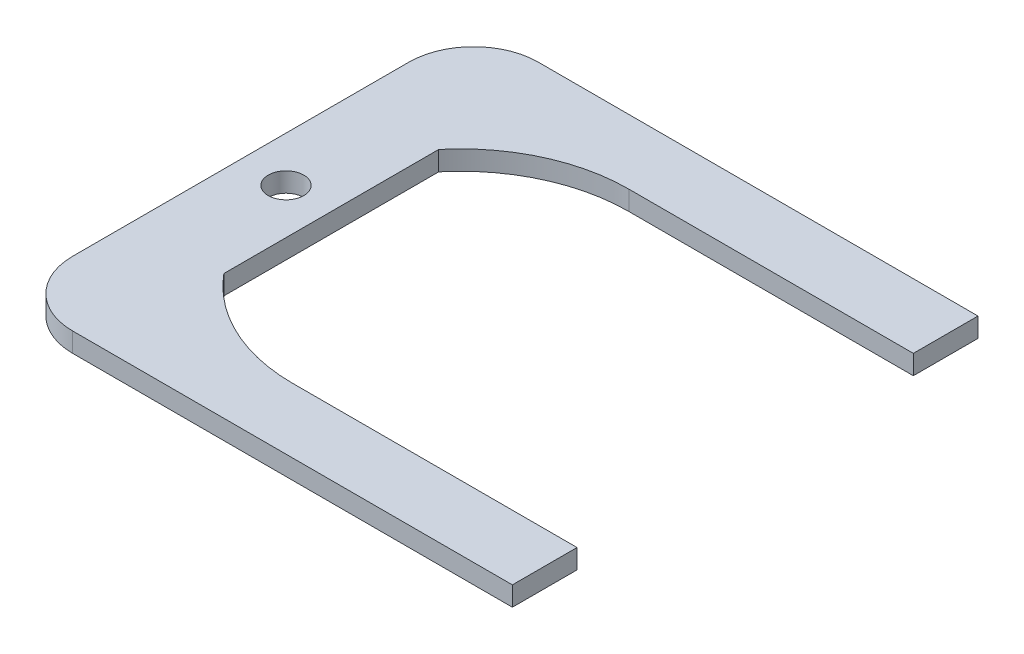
ISO-10303-21;
HEADER;
FILE_DESCRIPTION(('STEP AP214'),'2;1');
FILE_NAME('part.step','',(''),(''),'','','');
FILE_SCHEMA(('AUTOMOTIVE_DESIGN { 1 0 10303 214 1 1 1 1 }'));
ENDSEC;
DATA;
#1=APPLICATION_CONTEXT('core data for automotive mechanical design processes');
#2=APPLICATION_PROTOCOL_DEFINITION('international standard','automotive_design',2000,#1);
#3=PRODUCT_CONTEXT('',#1,'mechanical');
#4=PRODUCT('Part','Part','',(#3));
#5=PRODUCT_RELATED_PRODUCT_CATEGORY('part','',(#4));
#6=PRODUCT_DEFINITION_FORMATION('','',#4);
#7=PRODUCT_DEFINITION_CONTEXT('part definition',#1,'design');
#8=PRODUCT_DEFINITION('design','',#6,#7);
#9=PRODUCT_DEFINITION_SHAPE('','',#8);
#10=(LENGTH_UNIT() NAMED_UNIT(*) SI_UNIT(.MILLI.,.METRE.));
#11=(NAMED_UNIT(*) PLANE_ANGLE_UNIT() SI_UNIT($,.RADIAN.));
#12=(NAMED_UNIT(*) SI_UNIT($,.STERADIAN.) SOLID_ANGLE_UNIT());
#13=UNCERTAINTY_MEASURE_WITH_UNIT(LENGTH_MEASURE(1.E-05),#10,'distance_accuracy_value','');
#14=(GEOMETRIC_REPRESENTATION_CONTEXT(3) GLOBAL_UNCERTAINTY_ASSIGNED_CONTEXT((#13)) GLOBAL_UNIT_ASSIGNED_CONTEXT((#10,
#11,#12)) REPRESENTATION_CONTEXT('',''));
#15=CARTESIAN_POINT('',(0.,0.,0.));
#16=DIRECTION('',(0.,0.,1.));
#17=DIRECTION('',(1.,0.,0.));
#18=AXIS2_PLACEMENT_3D('',#15,#16,#17);
#19=CARTESIAN_POINT('',(3.,3.,-26.));
#20=DIRECTION('',(0.,-1.,0.));
#21=DIRECTION('',(0.,0.,-1.));
#22=AXIS2_PLACEMENT_3D('',#19,#20,#21);
#23=PLANE('',#22);
#24=CARTESIAN_POINT('',(3.,3.,-26.));
#25=DIRECTION('',(0.,1.,0.));
#26=DIRECTION('',(0.,0.,-1.));
#27=AXIS2_PLACEMENT_3D('',#24,#25,#26);
#28=CIRCLE('',#27,10.);
#29=CARTESIAN_POINT('',(3.00000000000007,3.,-36.));
#30=VERTEX_POINT('',#29);
#31=CARTESIAN_POINT('',(-7.,3.,-25.9999999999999));
#32=VERTEX_POINT('',#31);
#33=EDGE_CURVE('E184',#30,#32,#28,.T.);
#34=ORIENTED_EDGE('',*,*,#33,.T.);
#35=DIRECTION('',(0.,0.,1.));
#36=VECTOR('',#35,1.);
#37=CARTESIAN_POINT('',(-7.,3.,25.9999999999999));
#38=LINE('',#37,#36);
#39=CARTESIAN_POINT('',(-7.,3.,25.9999999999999));
#40=VERTEX_POINT('',#39);
#41=EDGE_CURVE('E112',#32,#40,#38,.T.);
#42=ORIENTED_EDGE('',*,*,#41,.T.);
#43=CARTESIAN_POINT('',(3.,3.,26.));
#44=DIRECTION('',(0.,1.,0.));
#45=DIRECTION('',(0.,0.,1.));
#46=AXIS2_PLACEMENT_3D('',#43,#44,#45);
#47=CIRCLE('',#46,10.);
#48=CARTESIAN_POINT('',(3.00000000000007,3.,36.));
#49=VERTEX_POINT('',#48);
#50=EDGE_CURVE('E211',#40,#49,#47,.T.);
#51=ORIENTED_EDGE('',*,*,#50,.T.);
#52=DIRECTION('',(1.,0.,0.));
#53=VECTOR('',#52,1.);
#54=CARTESIAN_POINT('',(3.00000000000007,3.,36.));
#55=LINE('',#54,#53);
#56=CARTESIAN_POINT('',(71.,3.,36.));
#57=VERTEX_POINT('',#56);
#58=EDGE_CURVE('E230',#49,#57,#55,.T.);
#59=ORIENTED_EDGE('',*,*,#58,.T.);
#60=DIRECTION('',(0.,0.,-1.));
#61=VECTOR('',#60,1.);
#62=CARTESIAN_POINT('',(71.,3.,36.));
#63=LINE('',#62,#61);
#64=CARTESIAN_POINT('',(71.,3.,26.));
#65=VERTEX_POINT('',#64);
#66=EDGE_CURVE('E227',#57,#65,#63,.T.);
#67=ORIENTED_EDGE('',*,*,#66,.T.);
#68=DIRECTION('',(-1.,0.,0.));
#69=VECTOR('',#68,1.);
#70=CARTESIAN_POINT('',(71.,3.,26.));
#71=LINE('',#70,#69);
#72=CARTESIAN_POINT('',(27.,3.,26.));
#73=VERTEX_POINT('',#72);
#74=EDGE_CURVE('E229',#65,#73,#71,.T.);
#75=ORIENTED_EDGE('',*,*,#74,.T.);
#76=CARTESIAN_POINT('',(27.,3.,0.));
#77=DIRECTION('',(0.,-1.,0.));
#78=DIRECTION('',(0.,0.,-1.));
#79=AXIS2_PLACEMENT_3D('',#76,#77,#78);
#80=CIRCLE('',#79,26.);
#81=CARTESIAN_POINT('',(7.00000000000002,3.,16.6132477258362));
#82=VERTEX_POINT('',#81);
#83=EDGE_CURVE('E232',#73,#82,#80,.T.);
#84=ORIENTED_EDGE('',*,*,#83,.T.);
#85=DIRECTION('',(0.,0.,-1.));
#86=VECTOR('',#85,1.);
#87=CARTESIAN_POINT('',(7.00000000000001,3.,-16.6132477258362));
#88=LINE('',#87,#86);
#89=CARTESIAN_POINT('',(7.00000000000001,3.,-16.6132477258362));
#90=VERTEX_POINT('',#89);
#91=EDGE_CURVE('E238',#82,#90,#88,.T.);
#92=ORIENTED_EDGE('',*,*,#91,.T.);
#93=CARTESIAN_POINT('',(27.,3.,0.));
#94=DIRECTION('',(0.,-1.,0.));
#95=DIRECTION('',(0.,0.,1.));
#96=AXIS2_PLACEMENT_3D('',#93,#94,#95);
#97=CIRCLE('',#96,26.);
#98=CARTESIAN_POINT('',(27.,3.,-26.));
#99=VERTEX_POINT('',#98);
#100=EDGE_CURVE('E143',#90,#99,#97,.T.);
#101=ORIENTED_EDGE('',*,*,#100,.T.);
#102=DIRECTION('',(1.,0.,0.));
#103=VECTOR('',#102,1.);
#104=CARTESIAN_POINT('',(71.,3.,-26.));
#105=LINE('',#104,#103);
#106=CARTESIAN_POINT('',(71.,3.,-26.));
#107=VERTEX_POINT('',#106);
#108=EDGE_CURVE('E137',#99,#107,#105,.T.);
#109=ORIENTED_EDGE('',*,*,#108,.T.);
#110=DIRECTION('',(0.,0.,-1.));
#111=VECTOR('',#110,1.);
#112=CARTESIAN_POINT('',(71.,3.,-36.));
#113=LINE('',#112,#111);
#114=CARTESIAN_POINT('',(71.,3.,-36.));
#115=VERTEX_POINT('',#114);
#116=EDGE_CURVE('E141',#107,#115,#113,.T.);
#117=ORIENTED_EDGE('',*,*,#116,.T.);
#118=DIRECTION('',(-1.,0.,0.));
#119=VECTOR('',#118,1.);
#120=CARTESIAN_POINT('',(3.00000000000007,3.,-36.));
#121=LINE('',#120,#119);
#122=EDGE_CURVE('E57',#115,#30,#121,.T.);
#123=ORIENTED_EDGE('',*,*,#122,.T.);
#124=EDGE_LOOP('',(#34,#42,#51,#59,#67,#75,#84,#92,#101,#109,#117,#123));
#125=FACE_BOUND('',#124,.T.);
#126=CARTESIAN_POINT('',(0.,3.,0.));
#127=DIRECTION('',(0.,1.,0.));
#128=DIRECTION('',(0.,0.,1.));
#129=AXIS2_PLACEMENT_3D('',#126,#127,#128);
#130=CIRCLE('',#129,2.75);
#131=CARTESIAN_POINT('',(0.,3.,2.75));
#132=VERTEX_POINT('',#131);
#133=EDGE_CURVE('E165',#132,#132,#130,.T.);
#134=ORIENTED_EDGE('',*,*,#133,.F.);
#135=EDGE_LOOP('',(#134));
#136=FACE_BOUND('',#135,.T.);
#137=ADVANCED_FACE('F40',(#125,#136),#23,.F.);
#138=CARTESIAN_POINT('',(3.,0.,-26.));
#139=DIRECTION('',(0.,-1.,0.));
#140=DIRECTION('',(0.,0.,-1.));
#141=AXIS2_PLACEMENT_3D('',#138,#139,#140);
#142=PLANE('',#141);
#143=CARTESIAN_POINT('',(3.,0.,-26.));
#144=DIRECTION('',(0.,1.,0.));
#145=DIRECTION('',(0.,0.,-1.));
#146=AXIS2_PLACEMENT_3D('',#143,#144,#145);
#147=CIRCLE('',#146,10.);
#148=CARTESIAN_POINT('',(3.00000000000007,0.,-36.));
#149=VERTEX_POINT('',#148);
#150=CARTESIAN_POINT('',(-7.,0.,-25.9999999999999));
#151=VERTEX_POINT('',#150);
#152=EDGE_CURVE('E161',#149,#151,#147,.T.);
#153=ORIENTED_EDGE('',*,*,#152,.F.);
#154=DIRECTION('',(-1.,0.,0.));
#155=VECTOR('',#154,1.);
#156=CARTESIAN_POINT('',(3.00000000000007,0.,-36.));
#157=LINE('',#156,#155);
#158=CARTESIAN_POINT('',(71.,0.,-36.));
#159=VERTEX_POINT('',#158);
#160=EDGE_CURVE('E104',#159,#149,#157,.T.);
#161=ORIENTED_EDGE('',*,*,#160,.F.);
#162=DIRECTION('',(0.,0.,-1.));
#163=VECTOR('',#162,1.);
#164=CARTESIAN_POINT('',(71.,0.,-36.));
#165=LINE('',#164,#163);
#166=CARTESIAN_POINT('',(71.,0.,-26.));
#167=VERTEX_POINT('',#166);
#168=EDGE_CURVE('E98',#167,#159,#165,.T.);
#169=ORIENTED_EDGE('',*,*,#168,.F.);
#170=DIRECTION('',(1.,0.,0.));
#171=VECTOR('',#170,1.);
#172=CARTESIAN_POINT('',(71.,0.,-26.));
#173=LINE('',#172,#171);
#174=CARTESIAN_POINT('',(27.,0.,-26.));
#175=VERTEX_POINT('',#174);
#176=EDGE_CURVE('E151',#175,#167,#173,.T.);
#177=ORIENTED_EDGE('',*,*,#176,.F.);
#178=CARTESIAN_POINT('',(27.,0.,0.));
#179=DIRECTION('',(0.,-1.,0.));
#180=DIRECTION('',(0.,0.,1.));
#181=AXIS2_PLACEMENT_3D('',#178,#179,#180);
#182=CIRCLE('',#181,26.);
#183=CARTESIAN_POINT('',(7.00000000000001,0.,-16.6132477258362));
#184=VERTEX_POINT('',#183);
#185=EDGE_CURVE('E179',#184,#175,#182,.T.);
#186=ORIENTED_EDGE('',*,*,#185,.F.);
#187=DIRECTION('',(0.,0.,-1.));
#188=VECTOR('',#187,1.);
#189=CARTESIAN_POINT('',(7.00000000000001,0.,-16.6132477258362));
#190=LINE('',#189,#188);
#191=CARTESIAN_POINT('',(7.00000000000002,0.,16.6132477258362));
#192=VERTEX_POINT('',#191);
#193=EDGE_CURVE('E177',#192,#184,#190,.T.);
#194=ORIENTED_EDGE('',*,*,#193,.F.);
#195=CARTESIAN_POINT('',(27.,0.,0.));
#196=DIRECTION('',(0.,-1.,0.));
#197=DIRECTION('',(0.,0.,-1.));
#198=AXIS2_PLACEMENT_3D('',#195,#196,#197);
#199=CIRCLE('',#198,26.);
#200=CARTESIAN_POINT('',(27.,0.,26.));
#201=VERTEX_POINT('',#200);
#202=EDGE_CURVE('E175',#201,#192,#199,.T.);
#203=ORIENTED_EDGE('',*,*,#202,.F.);
#204=DIRECTION('',(-1.,0.,0.));
#205=VECTOR('',#204,1.);
#206=CARTESIAN_POINT('',(71.,0.,26.));
#207=LINE('',#206,#205);
#208=CARTESIAN_POINT('',(71.,0.,26.));
#209=VERTEX_POINT('',#208);
#210=EDGE_CURVE('E173',#209,#201,#207,.T.);
#211=ORIENTED_EDGE('',*,*,#210,.F.);
#212=DIRECTION('',(0.,0.,-1.));
#213=VECTOR('',#212,1.);
#214=CARTESIAN_POINT('',(71.,0.,36.));
#215=LINE('',#214,#213);
#216=CARTESIAN_POINT('',(71.,0.,36.));
#217=VERTEX_POINT('',#216);
#218=EDGE_CURVE('E171',#217,#209,#215,.T.);
#219=ORIENTED_EDGE('',*,*,#218,.F.);
#220=DIRECTION('',(1.,0.,0.));
#221=VECTOR('',#220,1.);
#222=CARTESIAN_POINT('',(3.00000000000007,0.,36.));
#223=LINE('',#222,#221);
#224=CARTESIAN_POINT('',(3.00000000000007,0.,36.));
#225=VERTEX_POINT('',#224);
#226=EDGE_CURVE('E169',#225,#217,#223,.T.);
#227=ORIENTED_EDGE('',*,*,#226,.F.);
#228=CARTESIAN_POINT('',(3.,0.,26.));
#229=DIRECTION('',(0.,1.,0.));
#230=DIRECTION('',(0.,0.,1.));
#231=AXIS2_PLACEMENT_3D('',#228,#229,#230);
#232=CIRCLE('',#231,10.);
#233=CARTESIAN_POINT('',(-7.,0.,25.9999999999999));
#234=VERTEX_POINT('',#233);
#235=EDGE_CURVE('E167',#234,#225,#232,.T.);
#236=ORIENTED_EDGE('',*,*,#235,.F.);
#237=DIRECTION('',(0.,0.,1.));
#238=VECTOR('',#237,1.);
#239=CARTESIAN_POINT('',(-7.,0.,25.9999999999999));
#240=LINE('',#239,#238);
#241=EDGE_CURVE('E164',#151,#234,#240,.T.);
#242=ORIENTED_EDGE('',*,*,#241,.F.);
#243=EDGE_LOOP('',(#153,#161,#169,#177,#186,#194,#203,#211,#219,#227,#236,#242));
#244=FACE_BOUND('',#243,.T.);
#245=CARTESIAN_POINT('',(0.,0.,0.));
#246=DIRECTION('',(0.,1.,0.));
#247=DIRECTION('',(0.,0.,1.));
#248=AXIS2_PLACEMENT_3D('',#245,#246,#247);
#249=CIRCLE('',#248,2.75);
#250=CARTESIAN_POINT('',(0.,0.,2.75));
#251=VERTEX_POINT('',#250);
#252=EDGE_CURVE('E385',#251,#251,#249,.T.);
#253=ORIENTED_EDGE('',*,*,#252,.T.);
#254=EDGE_LOOP('',(#253));
#255=FACE_BOUND('',#254,.T.);
#256=ADVANCED_FACE('F215',(#244,#255),#142,.T.);
#257=CARTESIAN_POINT('',(3.,3.,-26.));
#258=DIRECTION('',(0.,-1.,0.));
#259=DIRECTION('',(0.,0.,-1.));
#260=AXIS2_PLACEMENT_3D('',#257,#258,#259);
#261=CYLINDRICAL_SURFACE('',#260,10.);
#262=ORIENTED_EDGE('',*,*,#152,.T.);
#263=DIRECTION('',(0.,-1.,0.));
#264=VECTOR('',#263,1.);
#265=CARTESIAN_POINT('',(-7.,3.,-25.9999999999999));
#266=LINE('',#265,#264);
#267=EDGE_CURVE('E13',#32,#151,#266,.T.);
#268=ORIENTED_EDGE('',*,*,#267,.F.);
#269=ORIENTED_EDGE('',*,*,#33,.F.);
#270=DIRECTION('',(0.,-1.,0.));
#271=VECTOR('',#270,1.);
#272=CARTESIAN_POINT('',(3.00000000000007,3.,-36.));
#273=LINE('',#272,#271);
#274=EDGE_CURVE('E157',#30,#149,#273,.T.);
#275=ORIENTED_EDGE('',*,*,#274,.T.);
#276=EDGE_LOOP('',(#262,#268,#269,#275));
#277=FACE_BOUND('',#276,.T.);
#278=ADVANCED_FACE('F42',(#277),#261,.T.);
#279=CARTESIAN_POINT('',(-7.,3.,25.9999999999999));
#280=DIRECTION('',(1.,0.,0.));
#281=DIRECTION('',(0.,0.,-1.));
#282=AXIS2_PLACEMENT_3D('',#279,#280,#281);
#283=PLANE('',#282);
#284=ORIENTED_EDGE('',*,*,#241,.T.);
#285=DIRECTION('',(0.,-1.,0.));
#286=VECTOR('',#285,1.);
#287=CARTESIAN_POINT('',(-7.,3.,25.9999999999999));
#288=LINE('',#287,#286);
#289=EDGE_CURVE('E49',#40,#234,#288,.T.);
#290=ORIENTED_EDGE('',*,*,#289,.F.);
#291=ORIENTED_EDGE('',*,*,#41,.F.);
#292=ORIENTED_EDGE('',*,*,#267,.T.);
#293=EDGE_LOOP('',(#284,#290,#291,#292));
#294=FACE_BOUND('',#293,.T.);
#295=ADVANCED_FACE('F272',(#294),#283,.F.);
#296=CARTESIAN_POINT('',(3.,3.,26.));
#297=DIRECTION('',(0.,-1.,0.));
#298=DIRECTION('',(0.,0.,-1.));
#299=AXIS2_PLACEMENT_3D('',#296,#297,#298);
#300=CYLINDRICAL_SURFACE('',#299,10.);
#301=ORIENTED_EDGE('',*,*,#235,.T.);
#302=DIRECTION('',(0.,-1.,0.));
#303=VECTOR('',#302,1.);
#304=CARTESIAN_POINT('',(3.00000000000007,3.,36.));
#305=LINE('',#304,#303);
#306=EDGE_CURVE('E203',#49,#225,#305,.T.);
#307=ORIENTED_EDGE('',*,*,#306,.F.);
#308=ORIENTED_EDGE('',*,*,#50,.F.);
#309=ORIENTED_EDGE('',*,*,#289,.T.);
#310=EDGE_LOOP('',(#301,#307,#308,#309));
#311=FACE_BOUND('',#310,.T.);
#312=ADVANCED_FACE('F209',(#311),#300,.T.);
#313=CARTESIAN_POINT('',(3.00000000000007,3.,36.));
#314=DIRECTION('',(0.,0.,-1.));
#315=DIRECTION('',(-1.,0.,0.));
#316=AXIS2_PLACEMENT_3D('',#313,#314,#315);
#317=PLANE('',#316);
#318=ORIENTED_EDGE('',*,*,#226,.T.);
#319=DIRECTION('',(0.,-1.,0.));
#320=VECTOR('',#319,1.);
#321=CARTESIAN_POINT('',(71.,3.,36.));
#322=LINE('',#321,#320);
#323=EDGE_CURVE('E200',#57,#217,#322,.T.);
#324=ORIENTED_EDGE('',*,*,#323,.F.);
#325=ORIENTED_EDGE('',*,*,#58,.F.);
#326=ORIENTED_EDGE('',*,*,#306,.T.);
#327=EDGE_LOOP('',(#318,#324,#325,#326));
#328=FACE_BOUND('',#327,.T.);
#329=ADVANCED_FACE('F221',(#328),#317,.F.);
#330=CARTESIAN_POINT('',(71.,3.,36.));
#331=DIRECTION('',(-1.,0.,0.));
#332=DIRECTION('',(0.,0.,1.));
#333=AXIS2_PLACEMENT_3D('',#330,#331,#332);
#334=PLANE('',#333);
#335=ORIENTED_EDGE('',*,*,#218,.T.);
#336=DIRECTION('',(0.,-1.,0.));
#337=VECTOR('',#336,1.);
#338=CARTESIAN_POINT('',(71.,3.,26.));
#339=LINE('',#338,#337);
#340=EDGE_CURVE('E197',#65,#209,#339,.T.);
#341=ORIENTED_EDGE('',*,*,#340,.F.);
#342=ORIENTED_EDGE('',*,*,#66,.F.);
#343=ORIENTED_EDGE('',*,*,#323,.T.);
#344=EDGE_LOOP('',(#335,#341,#342,#343));
#345=FACE_BOUND('',#344,.T.);
#346=ADVANCED_FACE('F225',(#345),#334,.F.);
#347=CARTESIAN_POINT('',(71.,3.,26.));
#348=DIRECTION('',(0.,0.,1.));
#349=DIRECTION('',(1.,0.,0.));
#350=AXIS2_PLACEMENT_3D('',#347,#348,#349);
#351=PLANE('',#350);
#352=ORIENTED_EDGE('',*,*,#210,.T.);
#353=DIRECTION('',(0.,-1.,0.));
#354=VECTOR('',#353,1.);
#355=CARTESIAN_POINT('',(27.,3.,26.));
#356=LINE('',#355,#354);
#357=EDGE_CURVE('E194',#73,#201,#356,.T.);
#358=ORIENTED_EDGE('',*,*,#357,.F.);
#359=ORIENTED_EDGE('',*,*,#74,.F.);
#360=ORIENTED_EDGE('',*,*,#340,.T.);
#361=EDGE_LOOP('',(#352,#358,#359,#360));
#362=FACE_BOUND('',#361,.T.);
#363=ADVANCED_FACE('F285',(#362),#351,.F.);
#364=CARTESIAN_POINT('',(27.,3.,0.));
#365=DIRECTION('',(0.,-1.,0.));
#366=DIRECTION('',(0.,0.,-1.));
#367=AXIS2_PLACEMENT_3D('',#364,#365,#366);
#368=CYLINDRICAL_SURFACE('',#367,26.);
#369=ORIENTED_EDGE('',*,*,#202,.T.);
#370=DIRECTION('',(0.,-1.,0.));
#371=VECTOR('',#370,1.);
#372=CARTESIAN_POINT('',(7.00000000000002,3.,16.6132477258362));
#373=LINE('',#372,#371);
#374=EDGE_CURVE('E191',#82,#192,#373,.T.);
#375=ORIENTED_EDGE('',*,*,#374,.F.);
#376=ORIENTED_EDGE('',*,*,#83,.F.);
#377=ORIENTED_EDGE('',*,*,#357,.T.);
#378=EDGE_LOOP('',(#369,#375,#376,#377));
#379=FACE_BOUND('',#378,.T.);
#380=ADVANCED_FACE('F288',(#379),#368,.F.);
#381=CARTESIAN_POINT('',(7.00000000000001,3.,-16.6132477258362));
#382=DIRECTION('',(-1.,0.,0.));
#383=DIRECTION('',(0.,0.,1.));
#384=AXIS2_PLACEMENT_3D('',#381,#382,#383);
#385=PLANE('',#384);
#386=ORIENTED_EDGE('',*,*,#193,.T.);
#387=DIRECTION('',(0.,-1.,0.));
#388=VECTOR('',#387,1.);
#389=CARTESIAN_POINT('',(7.00000000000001,3.,-16.6132477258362));
#390=LINE('',#389,#388);
#391=EDGE_CURVE('E188',#90,#184,#390,.T.);
#392=ORIENTED_EDGE('',*,*,#391,.F.);
#393=ORIENTED_EDGE('',*,*,#91,.F.);
#394=ORIENTED_EDGE('',*,*,#374,.T.);
#395=EDGE_LOOP('',(#386,#392,#393,#394));
#396=FACE_BOUND('',#395,.T.);
#397=ADVANCED_FACE('F244',(#396),#385,.F.);
#398=CARTESIAN_POINT('',(27.,3.,0.));
#399=DIRECTION('',(0.,-1.,0.));
#400=DIRECTION('',(0.,0.,-1.));
#401=AXIS2_PLACEMENT_3D('',#398,#399,#400);
#402=CYLINDRICAL_SURFACE('',#401,26.);
#403=ORIENTED_EDGE('',*,*,#185,.T.);
#404=DIRECTION('',(0.,-1.,0.));
#405=VECTOR('',#404,1.);
#406=CARTESIAN_POINT('',(27.,3.,-26.));
#407=LINE('',#406,#405);
#408=EDGE_CURVE('E152',#99,#175,#407,.T.);
#409=ORIENTED_EDGE('',*,*,#408,.F.);
#410=ORIENTED_EDGE('',*,*,#100,.F.);
#411=ORIENTED_EDGE('',*,*,#391,.T.);
#412=EDGE_LOOP('',(#403,#409,#410,#411));
#413=FACE_BOUND('',#412,.T.);
#414=ADVANCED_FACE('F248',(#413),#402,.F.);
#415=CARTESIAN_POINT('',(71.,3.,-26.));
#416=DIRECTION('',(0.,0.,-1.));
#417=DIRECTION('',(-1.,0.,0.));
#418=AXIS2_PLACEMENT_3D('',#415,#416,#417);
#419=PLANE('',#418);
#420=ORIENTED_EDGE('',*,*,#176,.T.);
#421=DIRECTION('',(0.,-1.,0.));
#422=VECTOR('',#421,1.);
#423=CARTESIAN_POINT('',(71.,3.,-26.));
#424=LINE('',#423,#422);
#425=EDGE_CURVE('E148',#107,#167,#424,.T.);
#426=ORIENTED_EDGE('',*,*,#425,.F.);
#427=ORIENTED_EDGE('',*,*,#108,.F.);
#428=ORIENTED_EDGE('',*,*,#408,.T.);
#429=EDGE_LOOP('',(#420,#426,#427,#428));
#430=FACE_BOUND('',#429,.T.);
#431=ADVANCED_FACE('F149',(#430),#419,.F.);
#432=CARTESIAN_POINT('',(71.,3.,-36.));
#433=DIRECTION('',(-1.,0.,0.));
#434=DIRECTION('',(0.,0.,1.));
#435=AXIS2_PLACEMENT_3D('',#432,#433,#434);
#436=PLANE('',#435);
#437=ORIENTED_EDGE('',*,*,#168,.T.);
#438=DIRECTION('',(0.,-1.,0.));
#439=VECTOR('',#438,1.);
#440=CARTESIAN_POINT('',(71.,3.,-36.));
#441=LINE('',#440,#439);
#442=EDGE_CURVE('E153',#115,#159,#441,.T.);
#443=ORIENTED_EDGE('',*,*,#442,.F.);
#444=ORIENTED_EDGE('',*,*,#116,.F.);
#445=ORIENTED_EDGE('',*,*,#425,.T.);
#446=EDGE_LOOP('',(#437,#443,#444,#445));
#447=FACE_BOUND('',#446,.T.);
#448=ADVANCED_FACE('F155',(#447),#436,.F.);
#449=CARTESIAN_POINT('',(3.00000000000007,3.,-36.));
#450=DIRECTION('',(0.,0.,1.));
#451=DIRECTION('',(1.,0.,0.));
#452=AXIS2_PLACEMENT_3D('',#449,#450,#451);
#453=PLANE('',#452);
#454=ORIENTED_EDGE('',*,*,#160,.T.);
#455=ORIENTED_EDGE('',*,*,#274,.F.);
#456=ORIENTED_EDGE('',*,*,#122,.F.);
#457=ORIENTED_EDGE('',*,*,#442,.T.);
#458=EDGE_LOOP('',(#454,#455,#456,#457));
#459=FACE_BOUND('',#458,.T.);
#460=ADVANCED_FACE('F252',(#459),#453,.F.);
#461=CARTESIAN_POINT('',(0.,3.,0.));
#462=DIRECTION('',(0.,-1.,0.));
#463=DIRECTION('',(0.,0.,-1.));
#464=AXIS2_PLACEMENT_3D('',#461,#462,#463);
#465=CYLINDRICAL_SURFACE('',#464,2.75);
#466=ORIENTED_EDGE('',*,*,#133,.T.);
#467=EDGE_LOOP('',(#466));
#468=FACE_BOUND('',#467,.T.);
#469=ORIENTED_EDGE('',*,*,#252,.F.);
#470=EDGE_LOOP('',(#469));
#471=FACE_BOUND('',#470,.T.);
#472=ADVANCED_FACE('F254',(#468,#471),#465,.F.);
#473=CLOSED_SHELL('',(#137,#256,#278,#295,#312,#329,#346,#363,#380,#397,#414,#431,#448,#460,#472));
#474=MANIFOLD_SOLID_BREP('B2',#473);
#475=ADVANCED_BREP_SHAPE_REPRESENTATION('',(#18,#474),#14);
#476=SHAPE_DEFINITION_REPRESENTATION(#9,#475);
ENDSEC;
END-ISO-10303-21;
